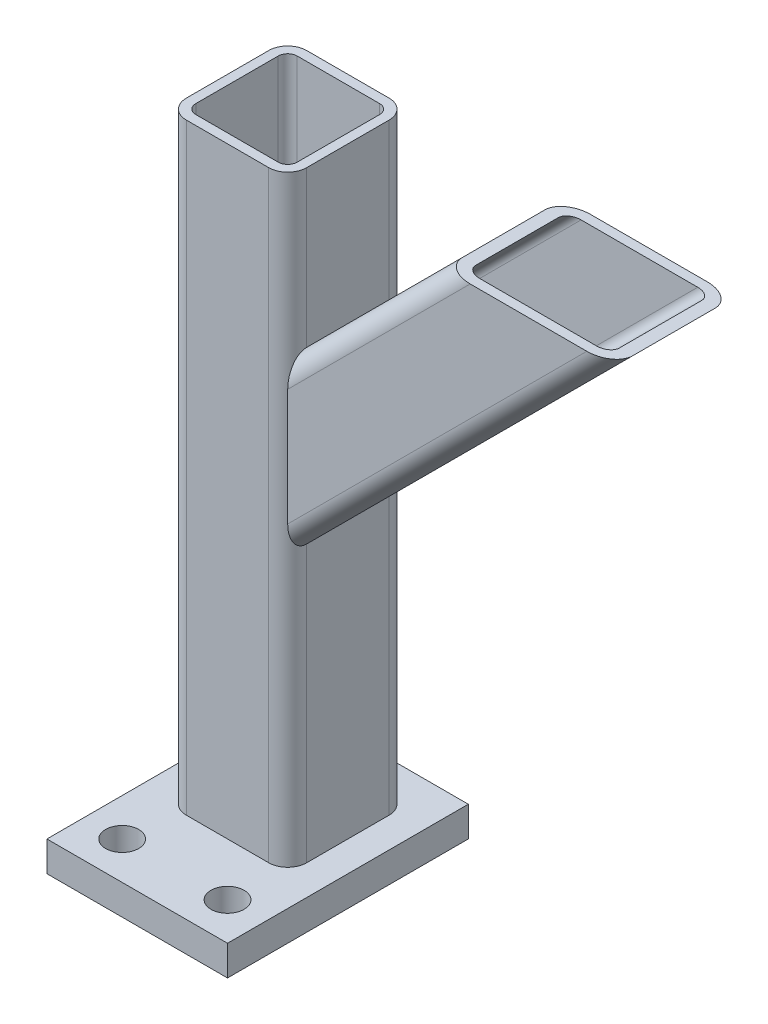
ISO-10303-21;
HEADER;
FILE_DESCRIPTION(('STEP AP214'),'2;1');
FILE_NAME('part.step','',(''),(''),'','','');
FILE_SCHEMA(('AUTOMOTIVE_DESIGN { 1 0 10303 214 1 1 1 1 }'));
ENDSEC;
DATA;
#1=APPLICATION_CONTEXT('core data for automotive mechanical design processes');
#2=APPLICATION_PROTOCOL_DEFINITION('international standard','automotive_design',2000,#1);
#3=PRODUCT_CONTEXT('',#1,'mechanical');
#4=PRODUCT('Part','Part','',(#3));
#5=PRODUCT_RELATED_PRODUCT_CATEGORY('part','',(#4));
#6=PRODUCT_DEFINITION_FORMATION('','',#4);
#7=PRODUCT_DEFINITION_CONTEXT('part definition',#1,'design');
#8=PRODUCT_DEFINITION('design','',#6,#7);
#9=PRODUCT_DEFINITION_SHAPE('','',#8);
#10=(LENGTH_UNIT() NAMED_UNIT(*) SI_UNIT(.MILLI.,.METRE.));
#11=(NAMED_UNIT(*) PLANE_ANGLE_UNIT() SI_UNIT($,.RADIAN.));
#12=(NAMED_UNIT(*) SI_UNIT($,.STERADIAN.) SOLID_ANGLE_UNIT());
#13=UNCERTAINTY_MEASURE_WITH_UNIT(LENGTH_MEASURE(1.E-05),#10,'distance_accuracy_value','');
#14=(GEOMETRIC_REPRESENTATION_CONTEXT(3) GLOBAL_UNCERTAINTY_ASSIGNED_CONTEXT((#13)) GLOBAL_UNIT_ASSIGNED_CONTEXT((#10,
#11,#12)) REPRESENTATION_CONTEXT('',''));
#15=CARTESIAN_POINT('',(0.,0.,0.));
#16=DIRECTION('',(0.,0.,1.));
#17=DIRECTION('',(1.,0.,0.));
#18=AXIS2_PLACEMENT_3D('',#15,#16,#17);
#19=CARTESIAN_POINT('',(-350.,0.,435.));
#20=DIRECTION('',(-1.,0.,0.));
#21=DIRECTION('',(0.,0.,1.));
#22=AXIS2_PLACEMENT_3D('',#19,#20,#21);
#23=PLANE('',#22);
#24=DIRECTION('',(0.,0.,1.));
#25=VECTOR('',#24,1.);
#26=CARTESIAN_POINT('',(-350.,20.,435.));
#27=LINE('',#26,#25);
#28=CARTESIAN_POINT('',(-350.,20.,275.));
#29=VERTEX_POINT('',#28);
#30=CARTESIAN_POINT('',(-350.,20.,435.));
#31=VERTEX_POINT('',#30);
#32=EDGE_CURVE('E112',#29,#31,#27,.T.);
#33=ORIENTED_EDGE('',*,*,#32,.F.);
#34=DIRECTION('',(0.,1.,0.));
#35=VECTOR('',#34,1.);
#36=CARTESIAN_POINT('',(-350.,0.,275.));
#37=LINE('',#36,#35);
#38=CARTESIAN_POINT('',(-350.,0.,275.));
#39=VERTEX_POINT('',#38);
#40=EDGE_CURVE('E12',#39,#29,#37,.T.);
#41=ORIENTED_EDGE('',*,*,#40,.F.);
#42=DIRECTION('',(0.,0.,1.));
#43=VECTOR('',#42,1.);
#44=CARTESIAN_POINT('',(-350.,0.,435.));
#45=LINE('',#44,#43);
#46=CARTESIAN_POINT('',(-350.,0.,435.));
#47=VERTEX_POINT('',#46);
#48=EDGE_CURVE('E105',#39,#47,#45,.T.);
#49=ORIENTED_EDGE('',*,*,#48,.T.);
#50=DIRECTION('',(0.,1.,0.));
#51=VECTOR('',#50,1.);
#52=CARTESIAN_POINT('',(-350.,0.,435.));
#53=LINE('',#52,#51);
#54=EDGE_CURVE('E50',#47,#31,#53,.T.);
#55=ORIENTED_EDGE('',*,*,#54,.T.);
#56=EDGE_LOOP('',(#33,#41,#49,#55));
#57=FACE_BOUND('',#56,.T.);
#58=ADVANCED_FACE('F47',(#57),#23,.T.);
#59=CARTESIAN_POINT('',(-350.,0.,275.));
#60=DIRECTION('',(0.,0.,-1.));
#61=DIRECTION('',(-1.,0.,0.));
#62=AXIS2_PLACEMENT_3D('',#59,#60,#61);
#63=PLANE('',#62);
#64=DIRECTION('',(-1.,0.,0.));
#65=VECTOR('',#64,1.);
#66=CARTESIAN_POINT('',(-350.,20.,275.));
#67=LINE('',#66,#65);
#68=CARTESIAN_POINT('',(-230.,20.,275.));
#69=VERTEX_POINT('',#68);
#70=EDGE_CURVE('E107',#69,#29,#67,.T.);
#71=ORIENTED_EDGE('',*,*,#70,.F.);
#72=DIRECTION('',(0.,1.,0.));
#73=VECTOR('',#72,1.);
#74=CARTESIAN_POINT('',(-230.,0.,275.));
#75=LINE('',#74,#73);
#76=CARTESIAN_POINT('',(-230.,0.,275.));
#77=VERTEX_POINT('',#76);
#78=EDGE_CURVE('E56',#77,#69,#75,.T.);
#79=ORIENTED_EDGE('',*,*,#78,.F.);
#80=DIRECTION('',(-1.,0.,0.));
#81=VECTOR('',#80,1.);
#82=CARTESIAN_POINT('',(-350.,0.,275.));
#83=LINE('',#82,#81);
#84=EDGE_CURVE('E102',#77,#39,#83,.T.);
#85=ORIENTED_EDGE('',*,*,#84,.T.);
#86=ORIENTED_EDGE('',*,*,#40,.T.);
#87=EDGE_LOOP('',(#71,#79,#85,#86));
#88=FACE_BOUND('',#87,.T.);
#89=ADVANCED_FACE('F123',(#88),#63,.T.);
#90=CARTESIAN_POINT('',(-230.,0.,435.));
#91=DIRECTION('',(1.,0.,0.));
#92=DIRECTION('',(0.,0.,-1.));
#93=AXIS2_PLACEMENT_3D('',#90,#91,#92);
#94=PLANE('',#93);
#95=DIRECTION('',(0.,0.,-1.));
#96=VECTOR('',#95,1.);
#97=CARTESIAN_POINT('',(-230.,20.,435.));
#98=LINE('',#97,#96);
#99=CARTESIAN_POINT('',(-230.,20.,435.));
#100=VERTEX_POINT('',#99);
#101=EDGE_CURVE('E97',#100,#69,#98,.T.);
#102=ORIENTED_EDGE('',*,*,#101,.F.);
#103=DIRECTION('',(0.,1.,0.));
#104=VECTOR('',#103,1.);
#105=CARTESIAN_POINT('',(-230.,0.,435.));
#106=LINE('',#105,#104);
#107=CARTESIAN_POINT('',(-230.,0.,435.));
#108=VERTEX_POINT('',#107);
#109=EDGE_CURVE('E92',#108,#100,#106,.T.);
#110=ORIENTED_EDGE('',*,*,#109,.F.);
#111=DIRECTION('',(0.,0.,-1.));
#112=VECTOR('',#111,1.);
#113=CARTESIAN_POINT('',(-230.,0.,435.));
#114=LINE('',#113,#112);
#115=EDGE_CURVE('E95',#108,#77,#114,.T.);
#116=ORIENTED_EDGE('',*,*,#115,.T.);
#117=ORIENTED_EDGE('',*,*,#78,.T.);
#118=EDGE_LOOP('',(#102,#110,#116,#117));
#119=FACE_BOUND('',#118,.T.);
#120=ADVANCED_FACE('F94',(#119),#94,.T.);
#121=CARTESIAN_POINT('',(-350.,0.,435.));
#122=DIRECTION('',(0.,0.,1.));
#123=DIRECTION('',(1.,0.,0.));
#124=AXIS2_PLACEMENT_3D('',#121,#122,#123);
#125=PLANE('',#124);
#126=DIRECTION('',(1.,0.,0.));
#127=VECTOR('',#126,1.);
#128=CARTESIAN_POINT('',(-350.,20.,435.));
#129=LINE('',#128,#127);
#130=EDGE_CURVE('E115',#31,#100,#129,.T.);
#131=ORIENTED_EDGE('',*,*,#130,.F.);
#132=ORIENTED_EDGE('',*,*,#54,.F.);
#133=DIRECTION('',(1.,0.,0.));
#134=VECTOR('',#133,1.);
#135=CARTESIAN_POINT('',(-350.,0.,435.));
#136=LINE('',#135,#134);
#137=EDGE_CURVE('E101',#47,#108,#136,.T.);
#138=ORIENTED_EDGE('',*,*,#137,.T.);
#139=ORIENTED_EDGE('',*,*,#109,.T.);
#140=EDGE_LOOP('',(#131,#132,#138,#139));
#141=FACE_BOUND('',#140,.T.);
#142=ADVANCED_FACE('F104',(#141),#125,.T.);
#143=CARTESIAN_POINT('',(0.,0.,0.));
#144=DIRECTION('',(0.,-1.,0.));
#145=DIRECTION('',(0.,0.,-1.));
#146=AXIS2_PLACEMENT_3D('',#143,#144,#145);
#147=PLANE('',#146);
#148=CARTESIAN_POINT('',(-325.,0.,410.));
#149=DIRECTION('',(0.,1.,0.));
#150=DIRECTION('',(0.,0.,1.));
#151=AXIS2_PLACEMENT_3D('',#148,#149,#150);
#152=CIRCLE('',#151,11.);
#153=CARTESIAN_POINT('',(-325.,0.,421.));
#154=VERTEX_POINT('',#153);
#155=EDGE_CURVE('E156',#154,#154,#152,.T.);
#156=ORIENTED_EDGE('',*,*,#155,.T.);
#157=EDGE_LOOP('',(#156));
#158=FACE_BOUND('',#157,.T.);
#159=CARTESIAN_POINT('',(-255.,0.,410.));
#160=DIRECTION('',(0.,1.,0.));
#161=DIRECTION('',(0.,0.,1.));
#162=AXIS2_PLACEMENT_3D('',#159,#160,#161);
#163=CIRCLE('',#162,11.);
#164=CARTESIAN_POINT('',(-255.,0.,421.));
#165=VERTEX_POINT('',#164);
#166=EDGE_CURVE('E116',#165,#165,#163,.T.);
#167=ORIENTED_EDGE('',*,*,#166,.T.);
#168=EDGE_LOOP('',(#167));
#169=FACE_BOUND('',#168,.T.);
#170=ORIENTED_EDGE('',*,*,#48,.F.);
#171=ORIENTED_EDGE('',*,*,#84,.F.);
#172=ORIENTED_EDGE('',*,*,#115,.F.);
#173=ORIENTED_EDGE('',*,*,#137,.F.);
#174=EDGE_LOOP('',(#170,#171,#172,#173));
#175=FACE_BOUND('',#174,.T.);
#176=ADVANCED_FACE('F100',(#158,#169,#175),#147,.T.);
#177=CARTESIAN_POINT('',(0.,20.,0.));
#178=DIRECTION('',(0.,-1.,0.));
#179=DIRECTION('',(0.,0.,-1.));
#180=AXIS2_PLACEMENT_3D('',#177,#178,#179);
#181=PLANE('',#180);
#182=CARTESIAN_POINT('',(-325.,20.,410.));
#183=DIRECTION('',(0.,1.,0.));
#184=DIRECTION('',(0.,0.,1.));
#185=AXIS2_PLACEMENT_3D('',#182,#183,#184);
#186=CIRCLE('',#185,11.);
#187=CARTESIAN_POINT('',(-325.,20.,421.));
#188=VERTEX_POINT('',#187);
#189=EDGE_CURVE('E159',#188,#188,#186,.T.);
#190=ORIENTED_EDGE('',*,*,#189,.F.);
#191=EDGE_LOOP('',(#190));
#192=FACE_BOUND('',#191,.T.);
#193=CARTESIAN_POINT('',(-255.,20.,410.));
#194=DIRECTION('',(0.,1.,0.));
#195=DIRECTION('',(0.,0.,1.));
#196=AXIS2_PLACEMENT_3D('',#193,#194,#195);
#197=CIRCLE('',#196,11.);
#198=CARTESIAN_POINT('',(-255.,20.,421.));
#199=VERTEX_POINT('',#198);
#200=EDGE_CURVE('E161',#199,#199,#197,.T.);
#201=ORIENTED_EDGE('',*,*,#200,.F.);
#202=EDGE_LOOP('',(#201));
#203=FACE_BOUND('',#202,.T.);
#204=ORIENTED_EDGE('',*,*,#32,.T.);
#205=ORIENTED_EDGE('',*,*,#130,.T.);
#206=ORIENTED_EDGE('',*,*,#101,.T.);
#207=ORIENTED_EDGE('',*,*,#70,.T.);
#208=EDGE_LOOP('',(#204,#205,#206,#207));
#209=FACE_BOUND('',#208,.T.);
#210=ADVANCED_FACE('F122',(#192,#203,#209),#181,.F.);
#211=CARTESIAN_POINT('',(-255.,20.,410.));
#212=DIRECTION('',(0.,1.,0.));
#213=DIRECTION('',(0.,0.,1.));
#214=AXIS2_PLACEMENT_3D('',#211,#212,#213);
#215=CYLINDRICAL_SURFACE('',#214,11.);
#216=ORIENTED_EDGE('',*,*,#166,.F.);
#217=EDGE_LOOP('',(#216));
#218=FACE_BOUND('',#217,.T.);
#219=ORIENTED_EDGE('',*,*,#200,.T.);
#220=EDGE_LOOP('',(#219));
#221=FACE_BOUND('',#220,.T.);
#222=ADVANCED_FACE('F141',(#218,#221),#215,.F.);
#223=CARTESIAN_POINT('',(-325.,20.,410.));
#224=DIRECTION('',(0.,1.,0.));
#225=DIRECTION('',(0.,0.,1.));
#226=AXIS2_PLACEMENT_3D('',#223,#224,#225);
#227=CYLINDRICAL_SURFACE('',#226,11.);
#228=ORIENTED_EDGE('',*,*,#155,.F.);
#229=EDGE_LOOP('',(#228));
#230=FACE_BOUND('',#229,.T.);
#231=ORIENTED_EDGE('',*,*,#189,.T.);
#232=EDGE_LOOP('',(#231));
#233=FACE_BOUND('',#232,.T.);
#234=ADVANCED_FACE('F148',(#230,#233),#227,.F.);
#235=CLOSED_SHELL('',(#58,#89,#120,#142,#176,#210,#222,#234));
#236=MANIFOLD_SOLID_BREP('B2',#235);
#237=CARTESIAN_POINT('',(-317.4,500.,362.4));
#238=DIRECTION('',(0.,-1.,0.));
#239=DIRECTION('',(1.,0.,0.));
#240=AXIS2_PLACEMENT_3D('',#237,#238,#239);
#241=CYLINDRICAL_SURFACE('',#240,12.6);
#242=CARTESIAN_POINT('',(-317.4,420.,362.4));
#243=DIRECTION('',(0.,1.,0.));
#244=DIRECTION('',(0.,0.,1.));
#245=AXIS2_PLACEMENT_3D('',#242,#243,#244);
#246=CIRCLE('',#245,12.6);
#247=CARTESIAN_POINT('',(-330.,420.,362.4));
#248=VERTEX_POINT('',#247);
#249=CARTESIAN_POINT('',(-317.4,420.,375.));
#250=VERTEX_POINT('',#249);
#251=EDGE_CURVE('E230',#248,#250,#246,.T.);
#252=ORIENTED_EDGE('',*,*,#251,.F.);
#253=DIRECTION('',(0.,-1.,0.));
#254=VECTOR('',#253,1.);
#255=CARTESIAN_POINT('',(-330.,500.,362.4));
#256=LINE('',#255,#254);
#257=CARTESIAN_POINT('',(-330.,20.,362.4));
#258=VERTEX_POINT('',#257);
#259=EDGE_CURVE('E370',#248,#258,#256,.T.);
#260=ORIENTED_EDGE('',*,*,#259,.T.);
#261=CARTESIAN_POINT('',(-317.4,20.,362.4));
#262=DIRECTION('',(0.,1.,0.));
#263=DIRECTION('',(0.707106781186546,0.,-0.707106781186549));
#264=AXIS2_PLACEMENT_3D('',#261,#262,#263);
#265=CIRCLE('',#264,12.6);
#266=CARTESIAN_POINT('',(-317.4,20.,375.));
#267=VERTEX_POINT('',#266);
#268=EDGE_CURVE('E371',#258,#267,#265,.T.);
#269=ORIENTED_EDGE('',*,*,#268,.T.);
#270=DIRECTION('',(0.,-1.,0.));
#271=VECTOR('',#270,1.);
#272=CARTESIAN_POINT('',(-317.4,500.,375.));
#273=LINE('',#272,#271);
#274=EDGE_CURVE('E390',#250,#267,#273,.T.);
#275=ORIENTED_EDGE('',*,*,#274,.F.);
#276=EDGE_LOOP('',(#252,#260,#269,#275));
#277=FACE_BOUND('',#276,.T.);
#278=ADVANCED_FACE('F221',(#277),#241,.T.);
#279=CARTESIAN_POINT('',(-317.4,500.,375.));
#280=DIRECTION('',(0.,0.,-1.));
#281=DIRECTION('',(-1.,0.,0.));
#282=AXIS2_PLACEMENT_3D('',#279,#280,#281);
#283=PLANE('',#282);
#284=DIRECTION('',(1.,0.,0.));
#285=VECTOR('',#284,1.);
#286=CARTESIAN_POINT('',(-450.,420.,375.));
#287=LINE('',#286,#285);
#288=CARTESIAN_POINT('',(-262.6,420.,375.));
#289=VERTEX_POINT('',#288);
#290=EDGE_CURVE('E45',#250,#289,#287,.T.);
#291=ORIENTED_EDGE('',*,*,#290,.F.);
#292=ORIENTED_EDGE('',*,*,#274,.T.);
#293=DIRECTION('',(1.,0.,0.));
#294=VECTOR('',#293,1.);
#295=CARTESIAN_POINT('',(-317.4,20.,375.));
#296=LINE('',#295,#294);
#297=CARTESIAN_POINT('',(-262.6,20.,375.));
#298=VERTEX_POINT('',#297);
#299=EDGE_CURVE('E389',#267,#298,#296,.T.);
#300=ORIENTED_EDGE('',*,*,#299,.T.);
#301=DIRECTION('',(0.,-1.,0.));
#302=VECTOR('',#301,1.);
#303=CARTESIAN_POINT('',(-262.6,500.,375.));
#304=LINE('',#303,#302);
#305=EDGE_CURVE('E387',#289,#298,#304,.T.);
#306=ORIENTED_EDGE('',*,*,#305,.F.);
#307=EDGE_LOOP('',(#291,#292,#300,#306));
#308=FACE_BOUND('',#307,.T.);
#309=ADVANCED_FACE('F471',(#308),#283,.F.);
#310=CARTESIAN_POINT('',(-262.6,500.,362.4));
#311=DIRECTION('',(0.,-1.,0.));
#312=DIRECTION('',(1.,0.,0.));
#313=AXIS2_PLACEMENT_3D('',#310,#311,#312);
#314=CYLINDRICAL_SURFACE('',#313,12.6);
#315=CARTESIAN_POINT('',(-262.6,420.,362.4));
#316=DIRECTION('',(0.,1.,0.));
#317=DIRECTION('',(0.,0.,1.));
#318=AXIS2_PLACEMENT_3D('',#315,#316,#317);
#319=CIRCLE('',#318,12.6);
#320=CARTESIAN_POINT('',(-250.,420.,362.4));
#321=VERTEX_POINT('',#320);
#322=EDGE_CURVE('E413',#289,#321,#319,.T.);
#323=ORIENTED_EDGE('',*,*,#322,.F.);
#324=ORIENTED_EDGE('',*,*,#305,.T.);
#325=CARTESIAN_POINT('',(-262.6,20.,362.4));
#326=DIRECTION('',(0.,1.,0.));
#327=DIRECTION('',(0.707106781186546,0.,-0.707106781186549));
#328=AXIS2_PLACEMENT_3D('',#325,#326,#327);
#329=CIRCLE('',#328,12.6);
#330=CARTESIAN_POINT('',(-250.,20.,362.4));
#331=VERTEX_POINT('',#330);
#332=EDGE_CURVE('E386',#298,#331,#329,.T.);
#333=ORIENTED_EDGE('',*,*,#332,.T.);
#334=DIRECTION('',(0.,-1.,0.));
#335=VECTOR('',#334,1.);
#336=CARTESIAN_POINT('',(-250.,500.,362.4));
#337=LINE('',#336,#335);
#338=EDGE_CURVE('E384',#321,#331,#337,.T.);
#339=ORIENTED_EDGE('',*,*,#338,.F.);
#340=EDGE_LOOP('',(#323,#324,#333,#339));
#341=FACE_BOUND('',#340,.T.);
#342=ADVANCED_FACE('F473',(#341),#314,.T.);
#343=CARTESIAN_POINT('',(-250.,500.,307.6));
#344=DIRECTION('',(-1.,0.,0.));
#345=DIRECTION('',(0.,0.,1.));
#346=AXIS2_PLACEMENT_3D('',#343,#344,#345);
#347=PLANE('',#346);
#348=DIRECTION('',(0.,0.,-1.));
#349=VECTOR('',#348,1.);
#350=CARTESIAN_POINT('',(-250.,420.,307.6));
#351=LINE('',#350,#349);
#352=CARTESIAN_POINT('',(-250.,420.,307.6));
#353=VERTEX_POINT('',#352);
#354=EDGE_CURVE('E411',#321,#353,#351,.T.);
#355=ORIENTED_EDGE('',*,*,#354,.F.);
#356=ORIENTED_EDGE('',*,*,#338,.T.);
#357=DIRECTION('',(0.,0.,-1.));
#358=VECTOR('',#357,1.);
#359=CARTESIAN_POINT('',(-250.,20.,307.6));
#360=LINE('',#359,#358);
#361=CARTESIAN_POINT('',(-250.,20.,307.6));
#362=VERTEX_POINT('',#361);
#363=EDGE_CURVE('E383',#331,#362,#360,.T.);
#364=ORIENTED_EDGE('',*,*,#363,.T.);
#365=DIRECTION('',(0.,-1.,0.));
#366=VECTOR('',#365,1.);
#367=CARTESIAN_POINT('',(-250.,500.,307.6));
#368=LINE('',#367,#366);
#369=EDGE_CURVE('E380',#353,#362,#368,.T.);
#370=ORIENTED_EDGE('',*,*,#369,.F.);
#371=EDGE_LOOP('',(#355,#356,#364,#370));
#372=FACE_BOUND('',#371,.T.);
#373=ADVANCED_FACE('F479',(#372),#347,.F.);
#374=CARTESIAN_POINT('',(-262.6,500.,307.6));
#375=DIRECTION('',(0.,-1.,0.));
#376=DIRECTION('',(1.,0.,0.));
#377=AXIS2_PLACEMENT_3D('',#374,#375,#376);
#378=CYLINDRICAL_SURFACE('',#377,12.6);
#379=CARTESIAN_POINT('',(-262.6,420.,307.6));
#380=DIRECTION('',(0.,1.,0.));
#381=DIRECTION('',(0.,0.,1.));
#382=AXIS2_PLACEMENT_3D('',#379,#380,#381);
#383=CIRCLE('',#382,12.6);
#384=CARTESIAN_POINT('',(-262.6,420.,295.));
#385=VERTEX_POINT('',#384);
#386=EDGE_CURVE('E397',#353,#385,#383,.T.);
#387=ORIENTED_EDGE('',*,*,#386,.F.);
#388=ORIENTED_EDGE('',*,*,#369,.T.);
#389=CARTESIAN_POINT('',(-262.6,20.,307.6));
#390=DIRECTION('',(0.,1.,0.));
#391=DIRECTION('',(0.707106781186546,0.,-0.707106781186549));
#392=AXIS2_PLACEMENT_3D('',#389,#390,#391);
#393=CIRCLE('',#392,12.6);
#394=CARTESIAN_POINT('',(-262.6,20.,295.));
#395=VERTEX_POINT('',#394);
#396=EDGE_CURVE('E382',#362,#395,#393,.T.);
#397=ORIENTED_EDGE('',*,*,#396,.T.);
#398=DIRECTION('',(0.,-1.,0.));
#399=VECTOR('',#398,1.);
#400=CARTESIAN_POINT('',(-262.6,500.,295.));
#401=LINE('',#400,#399);
#402=EDGE_CURVE('E377',#385,#395,#401,.T.);
#403=ORIENTED_EDGE('',*,*,#402,.F.);
#404=EDGE_LOOP('',(#387,#388,#397,#403));
#405=FACE_BOUND('',#404,.T.);
#406=ADVANCED_FACE('F482',(#405),#378,.T.);
#407=CARTESIAN_POINT('',(-262.6,500.,295.));
#408=DIRECTION('',(0.,0.,1.));
#409=DIRECTION('',(1.,0.,0.));
#410=AXIS2_PLACEMENT_3D('',#407,#408,#409);
#411=PLANE('',#410);
#412=DIRECTION('',(1.,0.,0.));
#413=VECTOR('',#412,1.);
#414=CARTESIAN_POINT('',(-450.,420.,295.));
#415=LINE('',#414,#413);
#416=CARTESIAN_POINT('',(-317.4,420.,295.));
#417=VERTEX_POINT('',#416);
#418=EDGE_CURVE('E379',#417,#385,#415,.T.);
#419=ORIENTED_EDGE('',*,*,#418,.T.);
#420=ORIENTED_EDGE('',*,*,#402,.T.);
#421=DIRECTION('',(-1.,0.,0.));
#422=VECTOR('',#421,1.);
#423=CARTESIAN_POINT('',(-262.6,20.,295.));
#424=LINE('',#423,#422);
#425=CARTESIAN_POINT('',(-317.4,20.,295.));
#426=VERTEX_POINT('',#425);
#427=EDGE_CURVE('E376',#395,#426,#424,.T.);
#428=ORIENTED_EDGE('',*,*,#427,.T.);
#429=DIRECTION('',(0.,-1.,0.));
#430=VECTOR('',#429,1.);
#431=CARTESIAN_POINT('',(-317.4,500.,295.));
#432=LINE('',#431,#430);
#433=EDGE_CURVE('E373',#417,#426,#432,.T.);
#434=ORIENTED_EDGE('',*,*,#433,.F.);
#435=EDGE_LOOP('',(#419,#420,#428,#434));
#436=FACE_BOUND('',#435,.T.);
#437=ADVANCED_FACE('F487',(#436),#411,.F.);
#438=CARTESIAN_POINT('',(-317.4,500.,307.6));
#439=DIRECTION('',(0.,-1.,0.));
#440=DIRECTION('',(1.,0.,0.));
#441=AXIS2_PLACEMENT_3D('',#438,#439,#440);
#442=CYLINDRICAL_SURFACE('',#441,12.6);
#443=CARTESIAN_POINT('',(-317.4,420.,307.6));
#444=DIRECTION('',(0.,1.,0.));
#445=DIRECTION('',(0.,0.,1.));
#446=AXIS2_PLACEMENT_3D('',#443,#444,#445);
#447=CIRCLE('',#446,12.6);
#448=CARTESIAN_POINT('',(-330.,420.,307.6));
#449=VERTEX_POINT('',#448);
#450=EDGE_CURVE('E394',#417,#449,#447,.T.);
#451=ORIENTED_EDGE('',*,*,#450,.F.);
#452=ORIENTED_EDGE('',*,*,#433,.T.);
#453=CARTESIAN_POINT('',(-317.4,20.,307.6));
#454=DIRECTION('',(0.,1.,0.));
#455=DIRECTION('',(0.707106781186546,0.,-0.707106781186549));
#456=AXIS2_PLACEMENT_3D('',#453,#454,#455);
#457=CIRCLE('',#456,12.6);
#458=CARTESIAN_POINT('',(-330.,20.,307.6));
#459=VERTEX_POINT('',#458);
#460=EDGE_CURVE('E375',#426,#459,#457,.T.);
#461=ORIENTED_EDGE('',*,*,#460,.T.);
#462=DIRECTION('',(0.,-1.,0.));
#463=VECTOR('',#462,1.);
#464=CARTESIAN_POINT('',(-330.,500.,307.6));
#465=LINE('',#464,#463);
#466=EDGE_CURVE('E352',#449,#459,#465,.T.);
#467=ORIENTED_EDGE('',*,*,#466,.F.);
#468=EDGE_LOOP('',(#451,#452,#461,#467));
#469=FACE_BOUND('',#468,.T.);
#470=ADVANCED_FACE('F489',(#469),#442,.T.);
#471=CARTESIAN_POINT('',(-262.6,500.,362.4));
#472=DIRECTION('',(0.,-1.,0.));
#473=DIRECTION('',(1.,0.,0.));
#474=AXIS2_PLACEMENT_3D('',#471,#472,#473);
#475=CYLINDRICAL_SURFACE('',#474,6.3);
#476=DIRECTION('',(0.,-1.,0.));
#477=VECTOR('',#476,1.);
#478=CARTESIAN_POINT('',(-262.6,500.,368.7));
#479=LINE('',#478,#477);
#480=CARTESIAN_POINT('',(-262.6,420.,368.7));
#481=VERTEX_POINT('',#480);
#482=CARTESIAN_POINT('',(-262.6,20.,368.7));
#483=VERTEX_POINT('',#482);
#484=EDGE_CURVE('E367',#481,#483,#479,.T.);
#485=ORIENTED_EDGE('',*,*,#484,.F.);
#486=CARTESIAN_POINT('',(-262.6,420.,362.4));
#487=DIRECTION('',(0.,1.,0.));
#488=DIRECTION('',(0.,0.,1.));
#489=AXIS2_PLACEMENT_3D('',#486,#487,#488);
#490=CIRCLE('',#489,6.3);
#491=CARTESIAN_POINT('',(-256.3,420.,362.4));
#492=VERTEX_POINT('',#491);
#493=EDGE_CURVE('E408',#481,#492,#490,.T.);
#494=ORIENTED_EDGE('',*,*,#493,.T.);
#495=DIRECTION('',(0.,-1.,0.));
#496=VECTOR('',#495,1.);
#497=CARTESIAN_POINT('',(-256.3,500.,362.4));
#498=LINE('',#497,#496);
#499=CARTESIAN_POINT('',(-256.3,20.,362.4));
#500=VERTEX_POINT('',#499);
#501=EDGE_CURVE('E224',#492,#500,#498,.T.);
#502=ORIENTED_EDGE('',*,*,#501,.T.);
#503=CARTESIAN_POINT('',(-262.6,20.,362.4));
#504=DIRECTION('',(0.,1.,0.));
#505=DIRECTION('',(0.707106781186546,0.,-0.707106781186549));
#506=AXIS2_PLACEMENT_3D('',#503,#504,#505);
#507=CIRCLE('',#506,6.3);
#508=EDGE_CURVE('E416',#483,#500,#507,.T.);
#509=ORIENTED_EDGE('',*,*,#508,.F.);
#510=EDGE_LOOP('',(#485,#494,#502,#509));
#511=FACE_BOUND('',#510,.T.);
#512=ADVANCED_FACE('F491',(#511),#475,.F.);
#513=CARTESIAN_POINT('',(-317.4,500.,368.7));
#514=DIRECTION('',(0.,0.,-1.));
#515=DIRECTION('',(-1.,0.,0.));
#516=AXIS2_PLACEMENT_3D('',#513,#514,#515);
#517=PLANE('',#516);
#518=DIRECTION('',(0.,-1.,0.));
#519=VECTOR('',#518,1.);
#520=CARTESIAN_POINT('',(-317.4,500.,368.7));
#521=LINE('',#520,#519);
#522=CARTESIAN_POINT('',(-317.4,420.,368.7));
#523=VERTEX_POINT('',#522);
#524=CARTESIAN_POINT('',(-317.4,20.,368.7));
#525=VERTEX_POINT('',#524);
#526=EDGE_CURVE('E364',#523,#525,#521,.T.);
#527=ORIENTED_EDGE('',*,*,#526,.F.);
#528=DIRECTION('',(1.,0.,0.));
#529=VECTOR('',#528,1.);
#530=CARTESIAN_POINT('',(-317.4,420.,368.7));
#531=LINE('',#530,#529);
#532=EDGE_CURVE('E369',#523,#481,#531,.T.);
#533=ORIENTED_EDGE('',*,*,#532,.T.);
#534=ORIENTED_EDGE('',*,*,#484,.T.);
#535=DIRECTION('',(1.,0.,0.));
#536=VECTOR('',#535,1.);
#537=CARTESIAN_POINT('',(-317.4,20.,368.7));
#538=LINE('',#537,#536);
#539=EDGE_CURVE('E415',#525,#483,#538,.T.);
#540=ORIENTED_EDGE('',*,*,#539,.F.);
#541=EDGE_LOOP('',(#527,#533,#534,#540));
#542=FACE_BOUND('',#541,.T.);
#543=ADVANCED_FACE('F497',(#542),#517,.T.);
#544=CARTESIAN_POINT('',(-317.4,500.,362.4));
#545=DIRECTION('',(0.,-1.,0.));
#546=DIRECTION('',(1.,0.,0.));
#547=AXIS2_PLACEMENT_3D('',#544,#545,#546);
#548=CYLINDRICAL_SURFACE('',#547,6.29999999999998);
#549=DIRECTION('',(0.,-1.,0.));
#550=VECTOR('',#549,1.);
#551=CARTESIAN_POINT('',(-323.7,500.,362.4));
#552=LINE('',#551,#550);
#553=CARTESIAN_POINT('',(-323.7,420.,362.4));
#554=VERTEX_POINT('',#553);
#555=CARTESIAN_POINT('',(-323.7,20.,362.4));
#556=VERTEX_POINT('',#555);
#557=EDGE_CURVE('E361',#554,#556,#552,.T.);
#558=ORIENTED_EDGE('',*,*,#557,.F.);
#559=CARTESIAN_POINT('',(-317.4,420.,362.4));
#560=DIRECTION('',(0.,1.,0.));
#561=DIRECTION('',(0.,0.,1.));
#562=AXIS2_PLACEMENT_3D('',#559,#560,#561);
#563=CIRCLE('',#562,6.29999999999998);
#564=EDGE_CURVE('E366',#554,#523,#563,.T.);
#565=ORIENTED_EDGE('',*,*,#564,.T.);
#566=ORIENTED_EDGE('',*,*,#526,.T.);
#567=CARTESIAN_POINT('',(-317.4,20.,362.4));
#568=DIRECTION('',(0.,1.,0.));
#569=DIRECTION('',(0.707106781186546,0.,-0.707106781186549));
#570=AXIS2_PLACEMENT_3D('',#567,#568,#569);
#571=CIRCLE('',#570,6.29999999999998);
#572=EDGE_CURVE('E422',#556,#525,#571,.T.);
#573=ORIENTED_EDGE('',*,*,#572,.F.);
#574=EDGE_LOOP('',(#558,#565,#566,#573));
#575=FACE_BOUND('',#574,.T.);
#576=ADVANCED_FACE('F544',(#575),#548,.F.);
#577=CARTESIAN_POINT('',(-323.7,500.,362.4));
#578=DIRECTION('',(1.,0.,0.));
#579=DIRECTION('',(0.,0.,-1.));
#580=AXIS2_PLACEMENT_3D('',#577,#578,#579);
#581=PLANE('',#580);
#582=DIRECTION('',(0.,-1.,0.));
#583=VECTOR('',#582,1.);
#584=CARTESIAN_POINT('',(-323.7,500.,307.6));
#585=LINE('',#584,#583);
#586=CARTESIAN_POINT('',(-323.7,420.,307.6));
#587=VERTEX_POINT('',#586);
#588=CARTESIAN_POINT('',(-323.7,20.,307.6));
#589=VERTEX_POINT('',#588);
#590=EDGE_CURVE('E358',#587,#589,#585,.T.);
#591=ORIENTED_EDGE('',*,*,#590,.F.);
#592=DIRECTION('',(0.,0.,1.));
#593=VECTOR('',#592,1.);
#594=CARTESIAN_POINT('',(-323.7,420.,362.4));
#595=LINE('',#594,#593);
#596=EDGE_CURVE('E363',#587,#554,#595,.T.);
#597=ORIENTED_EDGE('',*,*,#596,.T.);
#598=ORIENTED_EDGE('',*,*,#557,.T.);
#599=DIRECTION('',(0.,0.,1.));
#600=VECTOR('',#599,1.);
#601=CARTESIAN_POINT('',(-323.7,20.,362.4));
#602=LINE('',#601,#600);
#603=EDGE_CURVE('E425',#589,#556,#602,.T.);
#604=ORIENTED_EDGE('',*,*,#603,.F.);
#605=EDGE_LOOP('',(#591,#597,#598,#604));
#606=FACE_BOUND('',#605,.T.);
#607=ADVANCED_FACE('F554',(#606),#581,.T.);
#608=CARTESIAN_POINT('',(-317.4,500.,307.6));
#609=DIRECTION('',(0.,-1.,0.));
#610=DIRECTION('',(1.,0.,0.));
#611=AXIS2_PLACEMENT_3D('',#608,#609,#610);
#612=CYLINDRICAL_SURFACE('',#611,6.30000000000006);
#613=DIRECTION('',(0.,-1.,0.));
#614=VECTOR('',#613,1.);
#615=CARTESIAN_POINT('',(-317.4,500.,301.3));
#616=LINE('',#615,#614);
#617=CARTESIAN_POINT('',(-317.4,420.,301.3));
#618=VERTEX_POINT('',#617);
#619=CARTESIAN_POINT('',(-317.4,20.,301.3));
#620=VERTEX_POINT('',#619);
#621=EDGE_CURVE('E339',#618,#620,#616,.T.);
#622=ORIENTED_EDGE('',*,*,#621,.F.);
#623=CARTESIAN_POINT('',(-317.4,420.,307.6));
#624=DIRECTION('',(0.,1.,0.));
#625=DIRECTION('',(0.,0.,1.));
#626=AXIS2_PLACEMENT_3D('',#623,#624,#625);
#627=CIRCLE('',#626,6.30000000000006);
#628=EDGE_CURVE('E360',#618,#587,#627,.T.);
#629=ORIENTED_EDGE('',*,*,#628,.T.);
#630=ORIENTED_EDGE('',*,*,#590,.T.);
#631=CARTESIAN_POINT('',(-317.4,20.,307.6));
#632=DIRECTION('',(0.,1.,0.));
#633=DIRECTION('',(0.707106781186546,0.,-0.707106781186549));
#634=AXIS2_PLACEMENT_3D('',#631,#632,#633);
#635=CIRCLE('',#634,6.30000000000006);
#636=EDGE_CURVE('E428',#620,#589,#635,.T.);
#637=ORIENTED_EDGE('',*,*,#636,.F.);
#638=EDGE_LOOP('',(#622,#629,#630,#637));
#639=FACE_BOUND('',#638,.T.);
#640=ADVANCED_FACE('F564',(#639),#612,.F.);
#641=CARTESIAN_POINT('',(-262.6,500.,301.3));
#642=DIRECTION('',(0.,0.,1.));
#643=DIRECTION('',(1.,0.,0.));
#644=AXIS2_PLACEMENT_3D('',#641,#642,#643);
#645=PLANE('',#644);
#646=DIRECTION('',(0.,-1.,0.));
#647=VECTOR('',#646,1.);
#648=CARTESIAN_POINT('',(-262.6,500.,301.3));
#649=LINE('',#648,#647);
#650=CARTESIAN_POINT('',(-262.6,420.,301.3));
#651=VERTEX_POINT('',#650);
#652=CARTESIAN_POINT('',(-262.6,20.,301.3));
#653=VERTEX_POINT('',#652);
#654=EDGE_CURVE('E338',#651,#653,#649,.T.);
#655=ORIENTED_EDGE('',*,*,#654,.F.);
#656=DIRECTION('',(-1.,0.,0.));
#657=VECTOR('',#656,1.);
#658=CARTESIAN_POINT('',(-262.6,420.,301.3));
#659=LINE('',#658,#657);
#660=EDGE_CURVE('E334',#651,#618,#659,.T.);
#661=ORIENTED_EDGE('',*,*,#660,.T.);
#662=ORIENTED_EDGE('',*,*,#621,.T.);
#663=DIRECTION('',(-1.,0.,0.));
#664=VECTOR('',#663,1.);
#665=CARTESIAN_POINT('',(-262.6,20.,301.3));
#666=LINE('',#665,#664);
#667=EDGE_CURVE('E431',#653,#620,#666,.T.);
#668=ORIENTED_EDGE('',*,*,#667,.F.);
#669=EDGE_LOOP('',(#655,#661,#662,#668));
#670=FACE_BOUND('',#669,.T.);
#671=ADVANCED_FACE('F574',(#670),#645,.T.);
#672=CARTESIAN_POINT('',(-262.6,500.,307.6));
#673=DIRECTION('',(0.,-1.,0.));
#674=DIRECTION('',(1.,0.,0.));
#675=AXIS2_PLACEMENT_3D('',#672,#673,#674);
#676=CYLINDRICAL_SURFACE('',#675,6.3);
#677=DIRECTION('',(0.,-1.,0.));
#678=VECTOR('',#677,1.);
#679=CARTESIAN_POINT('',(-256.3,500.,307.6));
#680=LINE('',#679,#678);
#681=CARTESIAN_POINT('',(-256.3,420.,307.6));
#682=VERTEX_POINT('',#681);
#683=CARTESIAN_POINT('',(-256.3,20.,307.6));
#684=VERTEX_POINT('',#683);
#685=EDGE_CURVE('E345',#682,#684,#680,.T.);
#686=ORIENTED_EDGE('',*,*,#685,.F.);
#687=CARTESIAN_POINT('',(-262.6,420.,307.6));
#688=DIRECTION('',(0.,1.,0.));
#689=DIRECTION('',(0.,0.,1.));
#690=AXIS2_PLACEMENT_3D('',#687,#688,#689);
#691=CIRCLE('',#690,6.3);
#692=EDGE_CURVE('E328',#682,#651,#691,.T.);
#693=ORIENTED_EDGE('',*,*,#692,.T.);
#694=ORIENTED_EDGE('',*,*,#654,.T.);
#695=CARTESIAN_POINT('',(-262.6,20.,307.6));
#696=DIRECTION('',(0.,1.,0.));
#697=DIRECTION('',(0.707106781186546,0.,-0.707106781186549));
#698=AXIS2_PLACEMENT_3D('',#695,#696,#697);
#699=CIRCLE('',#698,6.3);
#700=EDGE_CURVE('E350',#684,#653,#699,.T.);
#701=ORIENTED_EDGE('',*,*,#700,.F.);
#702=EDGE_LOOP('',(#686,#693,#694,#701));
#703=FACE_BOUND('',#702,.T.);
#704=ADVANCED_FACE('F348',(#703),#676,.F.);
#705=CARTESIAN_POINT('',(-256.3,500.,307.6));
#706=DIRECTION('',(-1.,0.,0.));
#707=DIRECTION('',(0.,0.,1.));
#708=AXIS2_PLACEMENT_3D('',#705,#706,#707);
#709=PLANE('',#708);
#710=ORIENTED_EDGE('',*,*,#501,.F.);
#711=DIRECTION('',(0.,0.,-1.));
#712=VECTOR('',#711,1.);
#713=CARTESIAN_POINT('',(-256.3,420.,307.6));
#714=LINE('',#713,#712);
#715=EDGE_CURVE('E331',#492,#682,#714,.T.);
#716=ORIENTED_EDGE('',*,*,#715,.T.);
#717=ORIENTED_EDGE('',*,*,#685,.T.);
#718=DIRECTION('',(0.,0.,-1.));
#719=VECTOR('',#718,1.);
#720=CARTESIAN_POINT('',(-256.3,20.,307.6));
#721=LINE('',#720,#719);
#722=EDGE_CURVE('E419',#500,#684,#721,.T.);
#723=ORIENTED_EDGE('',*,*,#722,.F.);
#724=EDGE_LOOP('',(#710,#716,#717,#723));
#725=FACE_BOUND('',#724,.T.);
#726=ADVANCED_FACE('F343',(#725),#709,.T.);
#727=CARTESIAN_POINT('',(-330.,500.,362.4));
#728=DIRECTION('',(1.,0.,0.));
#729=DIRECTION('',(0.,0.,-1.));
#730=AXIS2_PLACEMENT_3D('',#727,#728,#729);
#731=PLANE('',#730);
#732=DIRECTION('',(0.,0.,1.));
#733=VECTOR('',#732,1.);
#734=CARTESIAN_POINT('',(-330.,420.,362.4));
#735=LINE('',#734,#733);
#736=EDGE_CURVE('E396',#449,#248,#735,.T.);
#737=ORIENTED_EDGE('',*,*,#736,.F.);
#738=ORIENTED_EDGE('',*,*,#466,.T.);
#739=DIRECTION('',(0.,0.,1.));
#740=VECTOR('',#739,1.);
#741=CARTESIAN_POINT('',(-330.,20.,362.4));
#742=LINE('',#741,#740);
#743=EDGE_CURVE('E353',#459,#258,#742,.T.);
#744=ORIENTED_EDGE('',*,*,#743,.T.);
#745=ORIENTED_EDGE('',*,*,#259,.F.);
#746=EDGE_LOOP('',(#737,#738,#744,#745));
#747=FACE_BOUND('',#746,.T.);
#748=ADVANCED_FACE('F460',(#747),#731,.F.);
#749=CARTESIAN_POINT('',(-317.4,20.,362.4));
#750=DIRECTION('',(0.,1.,0.));
#751=DIRECTION('',(0.707106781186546,0.,-0.707106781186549));
#752=AXIS2_PLACEMENT_3D('',#749,#750,#751);
#753=PLANE('',#752);
#754=ORIENTED_EDGE('',*,*,#508,.T.);
#755=ORIENTED_EDGE('',*,*,#722,.T.);
#756=ORIENTED_EDGE('',*,*,#700,.T.);
#757=ORIENTED_EDGE('',*,*,#667,.T.);
#758=ORIENTED_EDGE('',*,*,#636,.T.);
#759=ORIENTED_EDGE('',*,*,#603,.T.);
#760=ORIENTED_EDGE('',*,*,#572,.T.);
#761=ORIENTED_EDGE('',*,*,#539,.T.);
#762=EDGE_LOOP('',(#754,#755,#756,#757,#758,#759,#760,#761));
#763=FACE_BOUND('',#762,.T.);
#764=ORIENTED_EDGE('',*,*,#268,.F.);
#765=ORIENTED_EDGE('',*,*,#743,.F.);
#766=ORIENTED_EDGE('',*,*,#460,.F.);
#767=ORIENTED_EDGE('',*,*,#427,.F.);
#768=ORIENTED_EDGE('',*,*,#396,.F.);
#769=ORIENTED_EDGE('',*,*,#363,.F.);
#770=ORIENTED_EDGE('',*,*,#332,.F.);
#771=ORIENTED_EDGE('',*,*,#299,.F.);
#772=EDGE_LOOP('',(#764,#765,#766,#767,#768,#769,#770,#771));
#773=FACE_BOUND('',#772,.T.);
#774=ADVANCED_FACE('F466',(#763,#773),#753,.F.);
#775=CARTESIAN_POINT('',(-450.,420.,307.6));
#776=DIRECTION('',(0.,1.,0.));
#777=DIRECTION('',(0.,0.,1.));
#778=AXIS2_PLACEMENT_3D('',#775,#776,#777);
#779=PLANE('',#778);
#780=ORIENTED_EDGE('',*,*,#532,.F.);
#781=ORIENTED_EDGE('',*,*,#564,.F.);
#782=ORIENTED_EDGE('',*,*,#596,.F.);
#783=ORIENTED_EDGE('',*,*,#628,.F.);
#784=ORIENTED_EDGE('',*,*,#660,.F.);
#785=ORIENTED_EDGE('',*,*,#692,.F.);
#786=ORIENTED_EDGE('',*,*,#715,.F.);
#787=ORIENTED_EDGE('',*,*,#493,.F.);
#788=EDGE_LOOP('',(#780,#781,#782,#783,#784,#785,#786,#787));
#789=FACE_BOUND('',#788,.T.);
#790=ORIENTED_EDGE('',*,*,#322,.T.);
#791=ORIENTED_EDGE('',*,*,#354,.T.);
#792=ORIENTED_EDGE('',*,*,#386,.T.);
#793=ORIENTED_EDGE('',*,*,#418,.F.);
#794=ORIENTED_EDGE('',*,*,#450,.T.);
#795=ORIENTED_EDGE('',*,*,#736,.T.);
#796=ORIENTED_EDGE('',*,*,#251,.T.);
#797=ORIENTED_EDGE('',*,*,#290,.T.);
#798=EDGE_LOOP('',(#790,#791,#792,#793,#794,#795,#796,#797));
#799=FACE_BOUND('',#798,.T.);
#800=ADVANCED_FACE('F330',(#789,#799),#779,.T.);
#801=CLOSED_SHELL('',(#278,#309,#342,#373,#406,#437,#470,#512,#543,#576,#607,#640,#671,#704,
#726,#748,#774,#800));
#802=MANIFOLD_SOLID_BREP('B6',#801);
#803=CARTESIAN_POINT('',(13.8294985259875,476.170501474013,307.6));
#804=DIRECTION('',(-0.707106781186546,0.707106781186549,0.));
#805=DIRECTION('',(-0.707106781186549,-0.707106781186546,0.));
#806=AXIS2_PLACEMENT_3D('',#803,#804,#805);
#807=PLANE('',#806);
#808=DIRECTION('',(-0.707106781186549,-0.707106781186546,0.));
#809=VECTOR('',#808,1.);
#810=CARTESIAN_POINT('',(13.8294985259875,476.170501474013,307.6));
#811=LINE('',#810,#809);
#812=CARTESIAN_POINT('',(-42.3410029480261,420.,307.6));
#813=VERTEX_POINT('',#812);
#814=CARTESIAN_POINT('',(-250.,212.341002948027,307.6));
#815=VERTEX_POINT('',#814);
#816=EDGE_CURVE('E814',#813,#815,#811,.T.);
#817=ORIENTED_EDGE('',*,*,#816,.T.);
#818=DIRECTION('',(0.,0.,1.));
#819=VECTOR('',#818,1.);
#820=CARTESIAN_POINT('',(-250.,212.341002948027,307.6));
#821=LINE('',#820,#819);
#822=CARTESIAN_POINT('',(-250.,212.341002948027,362.4));
#823=VERTEX_POINT('',#822);
#824=EDGE_CURVE('E786',#815,#823,#821,.T.);
#825=ORIENTED_EDGE('',*,*,#824,.T.);
#826=DIRECTION('',(-0.707106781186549,-0.707106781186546,0.));
#827=VECTOR('',#826,1.);
#828=CARTESIAN_POINT('',(13.8294985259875,476.170501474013,362.4));
#829=LINE('',#828,#827);
#830=CARTESIAN_POINT('',(-42.341002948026,420.,362.4));
#831=VERTEX_POINT('',#830);
#832=EDGE_CURVE('E842',#831,#823,#829,.T.);
#833=ORIENTED_EDGE('',*,*,#832,.F.);
#834=DIRECTION('',(0.,0.,-1.));
#835=VECTOR('',#834,1.);
#836=CARTESIAN_POINT('',(-42.3410029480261,420.,307.6));
#837=LINE('',#836,#835);
#838=EDGE_CURVE('E840',#831,#813,#837,.T.);
#839=ORIENTED_EDGE('',*,*,#838,.T.);
#840=EDGE_LOOP('',(#817,#825,#833,#839));
#841=FACE_BOUND('',#840,.T.);
#842=ADVANCED_FACE('F658',(#841),#807,.T.);
#843=CARTESIAN_POINT('',(9.37472580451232,480.625274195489,307.6));
#844=DIRECTION('',(-0.707106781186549,-0.707106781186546,0.));
#845=DIRECTION('',(0.707106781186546,-0.707106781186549,0.));
#846=AXIS2_PLACEMENT_3D('',#843,#844,#845);
#847=CYLINDRICAL_SURFACE('',#846,6.3);
#848=DIRECTION('',(-0.707106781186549,-0.707106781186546,0.));
#849=VECTOR('',#848,1.);
#850=CARTESIAN_POINT('',(9.37472580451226,480.625274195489,301.3));
#851=LINE('',#850,#849);
#852=CARTESIAN_POINT('',(-51.2505483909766,420.,301.3));
#853=VERTEX_POINT('',#852);
#854=CARTESIAN_POINT('',(-250.,221.250548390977,301.3));
#855=VERTEX_POINT('',#854);
#856=EDGE_CURVE('E837',#853,#855,#851,.T.);
#857=ORIENTED_EDGE('',*,*,#856,.T.);
#858=CARTESIAN_POINT('',(-250.,221.250548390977,307.6));
#859=DIRECTION('',(-1.,0.,0.));
#860=DIRECTION('',(0.,-1.,0.));
#861=AXIS2_PLACEMENT_3D('',#858,#859,#860);
#862=ELLIPSE('',#861,8.90954544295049,6.3);
#863=EDGE_CURVE('E903',#855,#815,#862,.T.);
#864=ORIENTED_EDGE('',*,*,#863,.T.);
#865=ORIENTED_EDGE('',*,*,#816,.F.);
#866=CARTESIAN_POINT('',(-51.2505483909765,420.,307.6));
#867=DIRECTION('',(0.,1.,0.));
#868=DIRECTION('',(-1.,0.,0.));
#869=AXIS2_PLACEMENT_3D('',#866,#867,#868);
#870=ELLIPSE('',#869,8.90954544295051,6.3);
#871=EDGE_CURVE('E836',#813,#853,#870,.T.);
#872=ORIENTED_EDGE('',*,*,#871,.T.);
#873=EDGE_LOOP('',(#857,#864,#865,#872));
#874=FACE_BOUND('',#873,.T.);
#875=ADVANCED_FACE('F940',(#874),#847,.F.);
#876=CARTESIAN_POINT('',(9.37472580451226,480.625274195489,301.3));
#877=DIRECTION('',(0.,0.,1.));
#878=DIRECTION('',(0.,-1.,0.));
#879=AXIS2_PLACEMENT_3D('',#876,#877,#878);
#880=PLANE('',#879);
#881=DIRECTION('',(-0.707106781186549,-0.707106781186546,0.));
#882=VECTOR('',#881,1.);
#883=CARTESIAN_POINT('',(-29.3747258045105,519.374725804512,301.3));
#884=LINE('',#883,#882);
#885=CARTESIAN_POINT('',(-128.749451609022,420.,301.3));
#886=VERTEX_POINT('',#885);
#887=CARTESIAN_POINT('',(-250.,298.749451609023,301.3));
#888=VERTEX_POINT('',#887);
#889=EDGE_CURVE('E833',#886,#888,#884,.T.);
#890=ORIENTED_EDGE('',*,*,#889,.T.);
#891=DIRECTION('',(0.,-1.,0.));
#892=VECTOR('',#891,1.);
#893=CARTESIAN_POINT('',(-250.,480.625274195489,301.3));
#894=LINE('',#893,#892);
#895=EDGE_CURVE('E900',#888,#855,#894,.T.);
#896=ORIENTED_EDGE('',*,*,#895,.T.);
#897=ORIENTED_EDGE('',*,*,#856,.F.);
#898=DIRECTION('',(-1.,0.,0.));
#899=VECTOR('',#898,1.);
#900=CARTESIAN_POINT('',(9.37472580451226,420.,301.3));
#901=LINE('',#900,#899);
#902=EDGE_CURVE('E832',#853,#886,#901,.T.);
#903=ORIENTED_EDGE('',*,*,#902,.T.);
#904=EDGE_LOOP('',(#890,#896,#897,#903));
#905=FACE_BOUND('',#904,.T.);
#906=ADVANCED_FACE('F946',(#905),#880,.T.);
#907=CARTESIAN_POINT('',(-29.3747258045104,519.374725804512,307.6));
#908=DIRECTION('',(-0.707106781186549,-0.707106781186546,0.));
#909=DIRECTION('',(0.707106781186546,-0.707106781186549,0.));
#910=AXIS2_PLACEMENT_3D('',#907,#908,#909);
#911=CYLINDRICAL_SURFACE('',#910,6.30000000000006);
#912=DIRECTION('',(-0.707106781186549,-0.707106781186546,0.));
#913=VECTOR('',#912,1.);
#914=CARTESIAN_POINT('',(-33.8294985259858,523.829498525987,307.6));
#915=LINE('',#914,#913);
#916=CARTESIAN_POINT('',(-137.658997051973,420.,307.6));
#917=VERTEX_POINT('',#916);
#918=CARTESIAN_POINT('',(-250.,307.658997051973,307.6));
#919=VERTEX_POINT('',#918);
#920=EDGE_CURVE('E829',#917,#919,#915,.T.);
#921=ORIENTED_EDGE('',*,*,#920,.T.);
#922=CARTESIAN_POINT('',(-250.,298.749451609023,307.6));
#923=DIRECTION('',(-1.,0.,0.));
#924=DIRECTION('',(0.,-1.,0.));
#925=AXIS2_PLACEMENT_3D('',#922,#923,#924);
#926=ELLIPSE('',#925,8.90954544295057,6.30000000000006);
#927=EDGE_CURVE('E897',#919,#888,#926,.T.);
#928=ORIENTED_EDGE('',*,*,#927,.T.);
#929=ORIENTED_EDGE('',*,*,#889,.F.);
#930=CARTESIAN_POINT('',(-128.749451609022,420.,307.6));
#931=DIRECTION('',(0.,1.,0.));
#932=DIRECTION('',(-1.,0.,0.));
#933=AXIS2_PLACEMENT_3D('',#930,#931,#932);
#934=ELLIPSE('',#933,8.9095454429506,6.30000000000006);
#935=EDGE_CURVE('E828',#886,#917,#934,.T.);
#936=ORIENTED_EDGE('',*,*,#935,.T.);
#937=EDGE_LOOP('',(#921,#928,#929,#936));
#938=FACE_BOUND('',#937,.T.);
#939=ADVANCED_FACE('F953',(#938),#911,.F.);
#940=CARTESIAN_POINT('',(-33.8294985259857,523.829498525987,362.4));
#941=DIRECTION('',(0.707106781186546,-0.707106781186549,0.));
#942=DIRECTION('',(0.707106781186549,0.707106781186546,0.));
#943=AXIS2_PLACEMENT_3D('',#940,#941,#942);
#944=PLANE('',#943);
#945=DIRECTION('',(-0.707106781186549,-0.707106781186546,0.));
#946=VECTOR('',#945,1.);
#947=CARTESIAN_POINT('',(-33.8294985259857,523.829498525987,362.4));
#948=LINE('',#947,#946);
#949=CARTESIAN_POINT('',(-137.658997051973,420.,362.4));
#950=VERTEX_POINT('',#949);
#951=CARTESIAN_POINT('',(-250.,307.658997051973,362.4));
#952=VERTEX_POINT('',#951);
#953=EDGE_CURVE('E825',#950,#952,#948,.T.);
#954=ORIENTED_EDGE('',*,*,#953,.T.);
#955=DIRECTION('',(0.,0.,-1.));
#956=VECTOR('',#955,1.);
#957=CARTESIAN_POINT('',(-250.,307.658997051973,362.4));
#958=LINE('',#957,#956);
#959=EDGE_CURVE('E894',#952,#919,#958,.T.);
#960=ORIENTED_EDGE('',*,*,#959,.T.);
#961=ORIENTED_EDGE('',*,*,#920,.F.);
#962=DIRECTION('',(0.,0.,1.));
#963=VECTOR('',#962,1.);
#964=CARTESIAN_POINT('',(-137.658997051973,420.,362.4));
#965=LINE('',#964,#963);
#966=EDGE_CURVE('E824',#917,#950,#965,.T.);
#967=ORIENTED_EDGE('',*,*,#966,.T.);
#968=EDGE_LOOP('',(#954,#960,#961,#967));
#969=FACE_BOUND('',#968,.T.);
#970=ADVANCED_FACE('F957',(#969),#944,.T.);
#971=CARTESIAN_POINT('',(-29.3747258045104,519.374725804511,362.4));
#972=DIRECTION('',(-0.707106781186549,-0.707106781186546,0.));
#973=DIRECTION('',(0.707106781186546,-0.707106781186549,0.));
#974=AXIS2_PLACEMENT_3D('',#971,#972,#973);
#975=CYLINDRICAL_SURFACE('',#974,6.29999999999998);
#976=DIRECTION('',(-0.707106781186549,-0.707106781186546,0.));
#977=VECTOR('',#976,1.);
#978=CARTESIAN_POINT('',(-29.3747258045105,519.374725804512,368.7));
#979=LINE('',#978,#977);
#980=CARTESIAN_POINT('',(-128.749451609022,420.,368.7));
#981=VERTEX_POINT('',#980);
#982=CARTESIAN_POINT('',(-250.,298.749451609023,368.7));
#983=VERTEX_POINT('',#982);
#984=EDGE_CURVE('E821',#981,#983,#979,.T.);
#985=ORIENTED_EDGE('',*,*,#984,.T.);
#986=CARTESIAN_POINT('',(-250.,298.749451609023,362.4));
#987=DIRECTION('',(-1.,0.,0.));
#988=DIRECTION('',(0.,-1.,0.));
#989=AXIS2_PLACEMENT_3D('',#986,#987,#988);
#990=ELLIPSE('',#989,8.90954544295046,6.29999999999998);
#991=EDGE_CURVE('E891',#983,#952,#990,.T.);
#992=ORIENTED_EDGE('',*,*,#991,.T.);
#993=ORIENTED_EDGE('',*,*,#953,.F.);
#994=CARTESIAN_POINT('',(-128.749451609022,420.,362.4));
#995=DIRECTION('',(0.,1.,0.));
#996=DIRECTION('',(-1.,0.,0.));
#997=AXIS2_PLACEMENT_3D('',#994,#995,#996);
#998=ELLIPSE('',#997,8.90954544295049,6.29999999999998);
#999=EDGE_CURVE('E819',#950,#981,#998,.T.);
#1000=ORIENTED_EDGE('',*,*,#999,.T.);
#1001=EDGE_LOOP('',(#985,#992,#993,#1000));
#1002=FACE_BOUND('',#1001,.T.);
#1003=ADVANCED_FACE('F961',(#1002),#975,.F.);
#1004=CARTESIAN_POINT('',(-29.3747258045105,519.374725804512,368.7));
#1005=DIRECTION('',(0.,0.,-1.));
#1006=DIRECTION('',(0.,1.,0.));
#1007=AXIS2_PLACEMENT_3D('',#1004,#1005,#1006);
#1008=PLANE('',#1007);
#1009=DIRECTION('',(-0.707106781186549,-0.707106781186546,0.));
#1010=VECTOR('',#1009,1.);
#1011=CARTESIAN_POINT('',(9.37472580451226,480.625274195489,368.7));
#1012=LINE('',#1011,#1010);
#1013=CARTESIAN_POINT('',(-51.2505483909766,420.,368.7));
#1014=VERTEX_POINT('',#1013);
#1015=CARTESIAN_POINT('',(-250.,221.250548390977,368.7));
#1016=VERTEX_POINT('',#1015);
#1017=EDGE_CURVE('E816',#1014,#1016,#1012,.T.);
#1018=ORIENTED_EDGE('',*,*,#1017,.T.);
#1019=DIRECTION('',(0.,1.,0.));
#1020=VECTOR('',#1019,1.);
#1021=CARTESIAN_POINT('',(-250.,519.374725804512,368.7));
#1022=LINE('',#1021,#1020);
#1023=EDGE_CURVE('E888',#1016,#983,#1022,.T.);
#1024=ORIENTED_EDGE('',*,*,#1023,.T.);
#1025=ORIENTED_EDGE('',*,*,#984,.F.);
#1026=DIRECTION('',(1.,0.,0.));
#1027=VECTOR('',#1026,1.);
#1028=CARTESIAN_POINT('',(-29.3747258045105,420.,368.7));
#1029=LINE('',#1028,#1027);
#1030=EDGE_CURVE('E820',#981,#1014,#1029,.T.);
#1031=ORIENTED_EDGE('',*,*,#1030,.T.);
#1032=EDGE_LOOP('',(#1018,#1024,#1025,#1031));
#1033=FACE_BOUND('',#1032,.T.);
#1034=ADVANCED_FACE('F965',(#1033),#1008,.T.);
#1035=CARTESIAN_POINT('',(9.37472580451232,480.625274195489,362.4));
#1036=DIRECTION('',(-0.707106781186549,-0.707106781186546,0.));
#1037=DIRECTION('',(0.707106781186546,-0.707106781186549,0.));
#1038=AXIS2_PLACEMENT_3D('',#1035,#1036,#1037);
#1039=CYLINDRICAL_SURFACE('',#1038,6.3);
#1040=ORIENTED_EDGE('',*,*,#832,.T.);
#1041=CARTESIAN_POINT('',(-250.,221.250548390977,362.4));
#1042=DIRECTION('',(-1.,0.,0.));
#1043=DIRECTION('',(0.,-1.,0.));
#1044=AXIS2_PLACEMENT_3D('',#1041,#1042,#1043);
#1045=ELLIPSE('',#1044,8.90954544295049,6.3);
#1046=EDGE_CURVE('E673',#823,#1016,#1045,.T.);
#1047=ORIENTED_EDGE('',*,*,#1046,.T.);
#1048=ORIENTED_EDGE('',*,*,#1017,.F.);
#1049=CARTESIAN_POINT('',(-51.2505483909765,420.,362.4));
#1050=DIRECTION('',(0.,1.,0.));
#1051=DIRECTION('',(-1.,0.,0.));
#1052=AXIS2_PLACEMENT_3D('',#1049,#1050,#1051);
#1053=ELLIPSE('',#1052,8.90954544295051,6.3);
#1054=EDGE_CURVE('E810',#1014,#831,#1053,.T.);
#1055=ORIENTED_EDGE('',*,*,#1054,.T.);
#1056=EDGE_LOOP('',(#1040,#1047,#1048,#1055));
#1057=FACE_BOUND('',#1056,.T.);
#1058=ADVANCED_FACE('F935',(#1057),#1039,.F.);
#1059=CARTESIAN_POINT('',(-450.,420.,307.6));
#1060=DIRECTION('',(0.,1.,0.));
#1061=DIRECTION('',(0.,0.,1.));
#1062=AXIS2_PLACEMENT_3D('',#1059,#1060,#1061);
#1063=PLANE('',#1062);
#1064=ORIENTED_EDGE('',*,*,#1030,.F.);
#1065=ORIENTED_EDGE('',*,*,#999,.F.);
#1066=ORIENTED_EDGE('',*,*,#966,.F.);
#1067=ORIENTED_EDGE('',*,*,#935,.F.);
#1068=ORIENTED_EDGE('',*,*,#902,.F.);
#1069=ORIENTED_EDGE('',*,*,#871,.F.);
#1070=ORIENTED_EDGE('',*,*,#838,.F.);
#1071=ORIENTED_EDGE('',*,*,#1054,.F.);
#1072=EDGE_LOOP('',(#1064,#1065,#1066,#1067,#1068,#1069,#1070,#1071));
#1073=FACE_BOUND('',#1072,.T.);
#1074=CARTESIAN_POINT('',(-51.2505483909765,420.,362.4));
#1075=DIRECTION('',(0.,1.,0.));
#1076=DIRECTION('',(-1.,0.,0.));
#1077=AXIS2_PLACEMENT_3D('',#1074,#1075,#1076);
#1078=ELLIPSE('',#1077,17.819090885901,12.6);
#1079=CARTESIAN_POINT('',(-51.2505483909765,420.,375.));
#1080=VERTEX_POINT('',#1079);
#1081=CARTESIAN_POINT('',(-33.4314575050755,420.,362.4));
#1082=VERTEX_POINT('',#1081);
#1083=EDGE_CURVE('E813',#1080,#1082,#1078,.T.);
#1084=ORIENTED_EDGE('',*,*,#1083,.T.);
#1085=DIRECTION('',(0.,0.,-1.));
#1086=VECTOR('',#1085,1.);
#1087=CARTESIAN_POINT('',(-33.4314575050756,420.,307.6));
#1088=LINE('',#1087,#1086);
#1089=CARTESIAN_POINT('',(-33.4314575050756,420.,307.6));
#1090=VERTEX_POINT('',#1089);
#1091=EDGE_CURVE('E878',#1082,#1090,#1088,.T.);
#1092=ORIENTED_EDGE('',*,*,#1091,.T.);
#1093=CARTESIAN_POINT('',(-51.2505483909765,420.,307.6));
#1094=DIRECTION('',(0.,1.,0.));
#1095=DIRECTION('',(-1.,0.,0.));
#1096=AXIS2_PLACEMENT_3D('',#1093,#1094,#1095);
#1097=ELLIPSE('',#1096,17.819090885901,12.6);
#1098=CARTESIAN_POINT('',(-51.2505483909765,420.,295.));
#1099=VERTEX_POINT('',#1098);
#1100=EDGE_CURVE('E852',#1090,#1099,#1097,.T.);
#1101=ORIENTED_EDGE('',*,*,#1100,.T.);
#1102=DIRECTION('',(1.,0.,0.));
#1103=VECTOR('',#1102,1.);
#1104=CARTESIAN_POINT('',(-450.,420.,295.));
#1105=LINE('',#1104,#1103);
#1106=CARTESIAN_POINT('',(-128.749451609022,420.,295.));
#1107=VERTEX_POINT('',#1106);
#1108=EDGE_CURVE('E796',#1107,#1099,#1105,.T.);
#1109=ORIENTED_EDGE('',*,*,#1108,.F.);
#1110=CARTESIAN_POINT('',(-128.749451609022,420.,307.6));
#1111=DIRECTION('',(0.,1.,0.));
#1112=DIRECTION('',(-1.,0.,0.));
#1113=AXIS2_PLACEMENT_3D('',#1110,#1111,#1112);
#1114=ELLIPSE('',#1113,17.8190908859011,12.6);
#1115=CARTESIAN_POINT('',(-146.568542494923,420.,307.6));
#1116=VERTEX_POINT('',#1115);
#1117=EDGE_CURVE('E870',#1107,#1116,#1114,.T.);
#1118=ORIENTED_EDGE('',*,*,#1117,.T.);
#1119=DIRECTION('',(0.,0.,1.));
#1120=VECTOR('',#1119,1.);
#1121=CARTESIAN_POINT('',(-146.568542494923,420.,362.4));
#1122=LINE('',#1121,#1120);
#1123=CARTESIAN_POINT('',(-146.568542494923,420.,362.4));
#1124=VERTEX_POINT('',#1123);
#1125=EDGE_CURVE('E869',#1116,#1124,#1122,.T.);
#1126=ORIENTED_EDGE('',*,*,#1125,.T.);
#1127=CARTESIAN_POINT('',(-128.749451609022,420.,362.4));
#1128=DIRECTION('',(0.,1.,0.));
#1129=DIRECTION('',(-1.,0.,0.));
#1130=AXIS2_PLACEMENT_3D('',#1127,#1128,#1129);
#1131=ELLIPSE('',#1130,17.8190908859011,12.6);
#1132=CARTESIAN_POINT('',(-128.749451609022,420.,375.));
#1133=VERTEX_POINT('',#1132);
#1134=EDGE_CURVE('E867',#1124,#1133,#1131,.T.);
#1135=ORIENTED_EDGE('',*,*,#1134,.T.);
#1136=DIRECTION('',(1.,0.,0.));
#1137=VECTOR('',#1136,1.);
#1138=CARTESIAN_POINT('',(-450.,420.,375.));
#1139=LINE('',#1138,#1137);
#1140=EDGE_CURVE('E666',#1133,#1080,#1139,.T.);
#1141=ORIENTED_EDGE('',*,*,#1140,.T.);
#1142=EDGE_LOOP('',(#1084,#1092,#1101,#1109,#1118,#1126,#1135,#1141));
#1143=FACE_BOUND('',#1142,.T.);
#1144=ADVANCED_FACE('F873',(#1073,#1143),#1063,.T.);
#1145=CARTESIAN_POINT('',(-38.284271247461,528.284271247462,362.4));
#1146=DIRECTION('',(0.707106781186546,-0.707106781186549,0.));
#1147=DIRECTION('',(0.707106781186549,0.707106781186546,0.));
#1148=AXIS2_PLACEMENT_3D('',#1145,#1146,#1147);
#1149=PLANE('',#1148);
#1150=DIRECTION('',(0.,0.,-1.));
#1151=VECTOR('',#1150,1.);
#1152=CARTESIAN_POINT('',(-250.,316.568542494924,362.400000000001));
#1153=LINE('',#1152,#1151);
#1154=CARTESIAN_POINT('',(-250.,316.568542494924,362.4));
#1155=VERTEX_POINT('',#1154);
#1156=CARTESIAN_POINT('',(-250.,316.568542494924,307.6));
#1157=VERTEX_POINT('',#1156);
#1158=EDGE_CURVE('E219',#1155,#1157,#1153,.T.);
#1159=ORIENTED_EDGE('',*,*,#1158,.F.);
#1160=DIRECTION('',(-0.707106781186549,-0.707106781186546,0.));
#1161=VECTOR('',#1160,1.);
#1162=CARTESIAN_POINT('',(-38.284271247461,528.284271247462,362.4));
#1163=LINE('',#1162,#1161);
#1164=EDGE_CURVE('E785',#1124,#1155,#1163,.T.);
#1165=ORIENTED_EDGE('',*,*,#1164,.F.);
#1166=ORIENTED_EDGE('',*,*,#1125,.F.);
#1167=DIRECTION('',(-0.707106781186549,-0.707106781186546,0.));
#1168=VECTOR('',#1167,1.);
#1169=CARTESIAN_POINT('',(-38.284271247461,528.284271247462,307.6));
#1170=LINE('',#1169,#1168);
#1171=EDGE_CURVE('E811',#1116,#1157,#1170,.T.);
#1172=ORIENTED_EDGE('',*,*,#1171,.T.);
#1173=EDGE_LOOP('',(#1159,#1165,#1166,#1172));
#1174=FACE_BOUND('',#1173,.T.);
#1175=ADVANCED_FACE('F927',(#1174),#1149,.F.);
#1176=CARTESIAN_POINT('',(-29.3747258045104,519.374725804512,307.6));
#1177=DIRECTION('',(-0.707106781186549,-0.707106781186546,0.));
#1178=DIRECTION('',(0.707106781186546,-0.707106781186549,0.));
#1179=AXIS2_PLACEMENT_3D('',#1176,#1177,#1178);
#1180=CYLINDRICAL_SURFACE('',#1179,12.6);
#1181=CARTESIAN_POINT('',(-250.,298.749451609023,307.6));
#1182=DIRECTION('',(-1.,0.,0.));
#1183=DIRECTION('',(0.,-1.,0.));
#1184=AXIS2_PLACEMENT_3D('',#1181,#1182,#1183);
#1185=ELLIPSE('',#1184,17.819090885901,12.6);
#1186=CARTESIAN_POINT('',(-250.,298.749451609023,295.));
#1187=VERTEX_POINT('',#1186);
#1188=EDGE_CURVE('E776',#1157,#1187,#1185,.T.);
#1189=ORIENTED_EDGE('',*,*,#1188,.F.);
#1190=ORIENTED_EDGE('',*,*,#1171,.F.);
#1191=ORIENTED_EDGE('',*,*,#1117,.F.);
#1192=DIRECTION('',(-0.707106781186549,-0.707106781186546,0.));
#1193=VECTOR('',#1192,1.);
#1194=CARTESIAN_POINT('',(-29.3747258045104,519.374725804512,295.));
#1195=LINE('',#1194,#1193);
#1196=EDGE_CURVE('E807',#1107,#1187,#1195,.T.);
#1197=ORIENTED_EDGE('',*,*,#1196,.T.);
#1198=EDGE_LOOP('',(#1189,#1190,#1191,#1197));
#1199=FACE_BOUND('',#1198,.T.);
#1200=ADVANCED_FACE('F925',(#1199),#1180,.T.);
#1201=CARTESIAN_POINT('',(9.37472580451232,480.625274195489,295.));
#1202=DIRECTION('',(0.,0.,1.));
#1203=DIRECTION('',(0.,-1.,0.));
#1204=AXIS2_PLACEMENT_3D('',#1201,#1202,#1203);
#1205=PLANE('',#1204);
#1206=DIRECTION('',(0.,-1.,0.));
#1207=VECTOR('',#1206,1.);
#1208=CARTESIAN_POINT('',(-250.,500.,295.));
#1209=LINE('',#1208,#1207);
#1210=CARTESIAN_POINT('',(-250.,221.250548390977,295.));
#1211=VERTEX_POINT('',#1210);
#1212=EDGE_CURVE('E777',#1187,#1211,#1209,.T.);
#1213=ORIENTED_EDGE('',*,*,#1212,.F.);
#1214=ORIENTED_EDGE('',*,*,#1196,.F.);
#1215=ORIENTED_EDGE('',*,*,#1108,.T.);
#1216=DIRECTION('',(-0.707106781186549,-0.707106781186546,0.));
#1217=VECTOR('',#1216,1.);
#1218=CARTESIAN_POINT('',(9.37472580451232,480.625274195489,295.));
#1219=LINE('',#1218,#1217);
#1220=EDGE_CURVE('E804',#1099,#1211,#1219,.T.);
#1221=ORIENTED_EDGE('',*,*,#1220,.T.);
#1222=EDGE_LOOP('',(#1213,#1214,#1215,#1221));
#1223=FACE_BOUND('',#1222,.T.);
#1224=ADVANCED_FACE('F920',(#1223),#1205,.F.);
#1225=CARTESIAN_POINT('',(9.37472580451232,480.625274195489,307.6));
#1226=DIRECTION('',(-0.707106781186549,-0.707106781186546,0.));
#1227=DIRECTION('',(0.707106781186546,-0.707106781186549,0.));
#1228=AXIS2_PLACEMENT_3D('',#1225,#1226,#1227);
#1229=CYLINDRICAL_SURFACE('',#1228,12.6);
#1230=CARTESIAN_POINT('',(-250.,221.250548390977,307.6));
#1231=DIRECTION('',(-1.,0.,0.));
#1232=DIRECTION('',(0.,-1.,0.));
#1233=AXIS2_PLACEMENT_3D('',#1230,#1231,#1232);
#1234=ELLIPSE('',#1233,17.819090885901,12.6);
#1235=CARTESIAN_POINT('',(-250.,203.431457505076,307.6));
#1236=VERTEX_POINT('',#1235);
#1237=EDGE_CURVE('E885',#1211,#1236,#1234,.T.);
#1238=ORIENTED_EDGE('',*,*,#1237,.F.);
#1239=ORIENTED_EDGE('',*,*,#1220,.F.);
#1240=ORIENTED_EDGE('',*,*,#1100,.F.);
#1241=DIRECTION('',(-0.707106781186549,-0.707106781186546,0.));
#1242=VECTOR('',#1241,1.);
#1243=CARTESIAN_POINT('',(18.2842712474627,471.715728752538,307.6));
#1244=LINE('',#1243,#1242);
#1245=EDGE_CURVE('E801',#1090,#1236,#1244,.T.);
#1246=ORIENTED_EDGE('',*,*,#1245,.T.);
#1247=EDGE_LOOP('',(#1238,#1239,#1240,#1246));
#1248=FACE_BOUND('',#1247,.T.);
#1249=ADVANCED_FACE('F916',(#1248),#1229,.T.);
#1250=CARTESIAN_POINT('',(18.2842712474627,471.715728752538,307.6));
#1251=DIRECTION('',(-0.707106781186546,0.707106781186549,0.));
#1252=DIRECTION('',(-0.707106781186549,-0.707106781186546,0.));
#1253=AXIS2_PLACEMENT_3D('',#1250,#1251,#1252);
#1254=PLANE('',#1253);
#1255=DIRECTION('',(0.,0.,1.));
#1256=VECTOR('',#1255,1.);
#1257=CARTESIAN_POINT('',(-250.,203.431457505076,307.6));
#1258=LINE('',#1257,#1256);
#1259=CARTESIAN_POINT('',(-250.,203.431457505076,362.4));
#1260=VERTEX_POINT('',#1259);
#1261=EDGE_CURVE('E883',#1236,#1260,#1258,.T.);
#1262=ORIENTED_EDGE('',*,*,#1261,.F.);
#1263=ORIENTED_EDGE('',*,*,#1245,.F.);
#1264=ORIENTED_EDGE('',*,*,#1091,.F.);
#1265=DIRECTION('',(-0.707106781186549,-0.707106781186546,0.));
#1266=VECTOR('',#1265,1.);
#1267=CARTESIAN_POINT('',(18.2842712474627,471.715728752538,362.4));
#1268=LINE('',#1267,#1266);
#1269=EDGE_CURVE('E792',#1082,#1260,#1268,.T.);
#1270=ORIENTED_EDGE('',*,*,#1269,.T.);
#1271=EDGE_LOOP('',(#1262,#1263,#1264,#1270));
#1272=FACE_BOUND('',#1271,.T.);
#1273=ADVANCED_FACE('F1008',(#1272),#1254,.F.);
#1274=CARTESIAN_POINT('',(9.37472580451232,480.625274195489,362.4));
#1275=DIRECTION('',(-0.707106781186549,-0.707106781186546,0.));
#1276=DIRECTION('',(0.707106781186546,-0.707106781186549,0.));
#1277=AXIS2_PLACEMENT_3D('',#1274,#1275,#1276);
#1278=CYLINDRICAL_SURFACE('',#1277,12.6);
#1279=CARTESIAN_POINT('',(-250.,221.250548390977,362.4));
#1280=DIRECTION('',(-1.,0.,0.));
#1281=DIRECTION('',(0.,-1.,0.));
#1282=AXIS2_PLACEMENT_3D('',#1279,#1280,#1281);
#1283=ELLIPSE('',#1282,17.819090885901,12.6);
#1284=CARTESIAN_POINT('',(-250.,221.250548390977,375.));
#1285=VERTEX_POINT('',#1284);
#1286=EDGE_CURVE('E771',#1260,#1285,#1283,.T.);
#1287=ORIENTED_EDGE('',*,*,#1286,.F.);
#1288=ORIENTED_EDGE('',*,*,#1269,.F.);
#1289=ORIENTED_EDGE('',*,*,#1083,.F.);
#1290=DIRECTION('',(-0.707106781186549,-0.707106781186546,0.));
#1291=VECTOR('',#1290,1.);
#1292=CARTESIAN_POINT('',(9.37472580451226,480.625274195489,375.));
#1293=LINE('',#1292,#1291);
#1294=EDGE_CURVE('E790',#1080,#1285,#1293,.T.);
#1295=ORIENTED_EDGE('',*,*,#1294,.T.);
#1296=EDGE_LOOP('',(#1287,#1288,#1289,#1295));
#1297=FACE_BOUND('',#1296,.T.);
#1298=ADVANCED_FACE('F877',(#1297),#1278,.T.);
#1299=CARTESIAN_POINT('',(-29.3747258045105,519.374725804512,375.));
#1300=DIRECTION('',(0.,0.,-1.));
#1301=DIRECTION('',(0.,1.,0.));
#1302=AXIS2_PLACEMENT_3D('',#1299,#1300,#1301);
#1303=PLANE('',#1302);
#1304=DIRECTION('',(0.,-1.,0.));
#1305=VECTOR('',#1304,1.);
#1306=CARTESIAN_POINT('',(-250.,500.,375.));
#1307=LINE('',#1306,#1305);
#1308=CARTESIAN_POINT('',(-250.,298.749451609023,375.));
#1309=VERTEX_POINT('',#1308);
#1310=EDGE_CURVE('E768',#1309,#1285,#1307,.T.);
#1311=ORIENTED_EDGE('',*,*,#1310,.T.);
#1312=ORIENTED_EDGE('',*,*,#1294,.F.);
#1313=ORIENTED_EDGE('',*,*,#1140,.F.);
#1314=DIRECTION('',(-0.707106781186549,-0.707106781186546,0.));
#1315=VECTOR('',#1314,1.);
#1316=CARTESIAN_POINT('',(-29.3747258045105,519.374725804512,375.));
#1317=LINE('',#1316,#1315);
#1318=EDGE_CURVE('E783',#1133,#1309,#1317,.T.);
#1319=ORIENTED_EDGE('',*,*,#1318,.T.);
#1320=EDGE_LOOP('',(#1311,#1312,#1313,#1319));
#1321=FACE_BOUND('',#1320,.T.);
#1322=ADVANCED_FACE('F789',(#1321),#1303,.F.);
#1323=CARTESIAN_POINT('',(-29.3747258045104,519.374725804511,362.4));
#1324=DIRECTION('',(-0.707106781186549,-0.707106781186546,0.));
#1325=DIRECTION('',(0.707106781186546,-0.707106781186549,0.));
#1326=AXIS2_PLACEMENT_3D('',#1323,#1324,#1325);
#1327=CYLINDRICAL_SURFACE('',#1326,12.6);
#1328=CARTESIAN_POINT('',(-250.,298.749451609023,362.4));
#1329=DIRECTION('',(-1.,0.,0.));
#1330=DIRECTION('',(0.,-1.,0.));
#1331=AXIS2_PLACEMENT_3D('',#1328,#1329,#1330);
#1332=ELLIPSE('',#1331,17.819090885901,12.6);
#1333=EDGE_CURVE('E680',#1309,#1155,#1332,.T.);
#1334=ORIENTED_EDGE('',*,*,#1333,.F.);
#1335=ORIENTED_EDGE('',*,*,#1318,.F.);
#1336=ORIENTED_EDGE('',*,*,#1134,.F.);
#1337=ORIENTED_EDGE('',*,*,#1164,.T.);
#1338=EDGE_LOOP('',(#1334,#1335,#1336,#1337));
#1339=FACE_BOUND('',#1338,.T.);
#1340=ADVANCED_FACE('F660',(#1339),#1327,.T.);
#1341=CARTESIAN_POINT('',(-250.,500.,307.6));
#1342=DIRECTION('',(-1.,0.,0.));
#1343=DIRECTION('',(0.,0.,1.));
#1344=AXIS2_PLACEMENT_3D('',#1341,#1342,#1343);
#1345=PLANE('',#1344);
#1346=ORIENTED_EDGE('',*,*,#824,.F.);
#1347=ORIENTED_EDGE('',*,*,#863,.F.);
#1348=ORIENTED_EDGE('',*,*,#895,.F.);
#1349=ORIENTED_EDGE('',*,*,#927,.F.);
#1350=ORIENTED_EDGE('',*,*,#959,.F.);
#1351=ORIENTED_EDGE('',*,*,#991,.F.);
#1352=ORIENTED_EDGE('',*,*,#1023,.F.);
#1353=ORIENTED_EDGE('',*,*,#1046,.F.);
#1354=EDGE_LOOP('',(#1346,#1347,#1348,#1349,#1350,#1351,#1352,#1353));
#1355=FACE_BOUND('',#1354,.T.);
#1356=ORIENTED_EDGE('',*,*,#1286,.T.);
#1357=ORIENTED_EDGE('',*,*,#1310,.F.);
#1358=ORIENTED_EDGE('',*,*,#1333,.T.);
#1359=ORIENTED_EDGE('',*,*,#1158,.T.);
#1360=ORIENTED_EDGE('',*,*,#1188,.T.);
#1361=ORIENTED_EDGE('',*,*,#1212,.T.);
#1362=ORIENTED_EDGE('',*,*,#1237,.T.);
#1363=ORIENTED_EDGE('',*,*,#1261,.T.);
#1364=EDGE_LOOP('',(#1356,#1357,#1358,#1359,#1360,#1361,#1362,#1363));
#1365=FACE_BOUND('',#1364,.T.);
#1366=ADVANCED_FACE('F769',(#1355,#1365),#1345,.T.);
#1367=CLOSED_SHELL('',(#842,#875,#906,#939,#970,#1003,#1034,#1058,#1144,#1175,#1200,#1224,#1249,
#1273,#1298,#1322,#1340,#1366));
#1368=MANIFOLD_SOLID_BREP('B39',#1367);
#1369=ADVANCED_BREP_SHAPE_REPRESENTATION('',(#18,#236,#802,#1368),#14);
#1370=SHAPE_DEFINITION_REPRESENTATION(#9,#1369);
ENDSEC;
END-ISO-10303-21;
